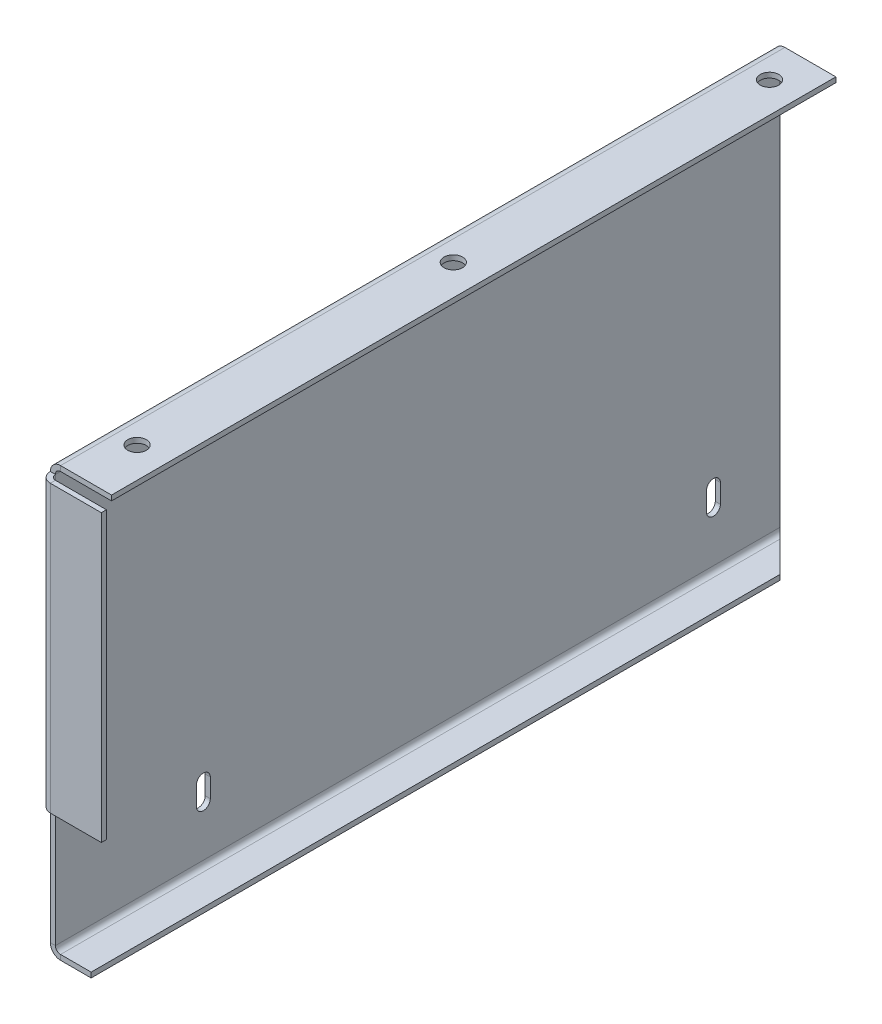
ISO-10303-21;
HEADER;
FILE_DESCRIPTION(('STEP AP214'),'2;1');
FILE_NAME('part.step','',(''),(''),'','','');
FILE_SCHEMA(('AUTOMOTIVE_DESIGN { 1 0 10303 214 1 1 1 1 }'));
ENDSEC;
DATA;
#1=APPLICATION_CONTEXT('core data for automotive mechanical design processes');
#2=APPLICATION_PROTOCOL_DEFINITION('international standard','automotive_design',2000,#1);
#3=PRODUCT_CONTEXT('',#1,'mechanical');
#4=PRODUCT('Part','Part','',(#3));
#5=PRODUCT_RELATED_PRODUCT_CATEGORY('part','',(#4));
#6=PRODUCT_DEFINITION_FORMATION('','',#4);
#7=PRODUCT_DEFINITION_CONTEXT('part definition',#1,'design');
#8=PRODUCT_DEFINITION('design','',#6,#7);
#9=PRODUCT_DEFINITION_SHAPE('','',#8);
#10=(LENGTH_UNIT() NAMED_UNIT(*) SI_UNIT(.MILLI.,.METRE.));
#11=(NAMED_UNIT(*) PLANE_ANGLE_UNIT() SI_UNIT($,.RADIAN.));
#12=(NAMED_UNIT(*) SI_UNIT($,.STERADIAN.) SOLID_ANGLE_UNIT());
#13=UNCERTAINTY_MEASURE_WITH_UNIT(LENGTH_MEASURE(1.E-05),#10,'distance_accuracy_value','');
#14=(GEOMETRIC_REPRESENTATION_CONTEXT(3) GLOBAL_UNCERTAINTY_ASSIGNED_CONTEXT((#13)) GLOBAL_UNIT_ASSIGNED_CONTEXT((#10,
#11,#12)) REPRESENTATION_CONTEXT('',''));
#15=CARTESIAN_POINT('',(0.,0.,0.));
#16=DIRECTION('',(0.,0.,1.));
#17=DIRECTION('',(1.,0.,0.));
#18=AXIS2_PLACEMENT_3D('',#15,#16,#17);
#19=CARTESIAN_POINT('',(0.,-3.33066907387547E-13,355.));
#20=DIRECTION('',(0.,1.,0.));
#21=DIRECTION('',(0.,0.,1.));
#22=AXIS2_PLACEMENT_3D('',#19,#20,#21);
#23=PLANE('',#22);
#24=DIRECTION('',(-0.707106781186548,0.,-0.707106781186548));
#25=VECTOR('',#24,1.);
#26=CARTESIAN_POINT('',(2.5,0.,0.));
#27=LINE('',#26,#25);
#28=CARTESIAN_POINT('',(20.,-3.33066907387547E-13,17.5000000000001));
#29=VERTEX_POINT('',#28);
#30=CARTESIAN_POINT('',(5.00000000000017,0.,2.50000000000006));
#31=VERTEX_POINT('',#30);
#32=EDGE_CURVE('E333',#29,#31,#27,.T.);
#33=ORIENTED_EDGE('',*,*,#32,.F.);
#34=DIRECTION('',(0.,0.,-1.));
#35=VECTOR('',#34,1.);
#36=CARTESIAN_POINT('',(20.,-6.66133814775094E-13,355.));
#37=LINE('',#36,#35);
#38=CARTESIAN_POINT('',(20.,-6.66133814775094E-13,355.));
#39=VERTEX_POINT('',#38);
#40=EDGE_CURVE('E510',#39,#29,#37,.T.);
#41=ORIENTED_EDGE('',*,*,#40,.F.);
#42=DIRECTION('',(1.,0.,0.));
#43=VECTOR('',#42,1.);
#44=CARTESIAN_POINT('',(0.,-3.33066907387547E-13,355.));
#45=LINE('',#44,#43);
#46=CARTESIAN_POINT('',(5.,-3.33066907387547E-13,355.));
#47=VERTEX_POINT('',#46);
#48=EDGE_CURVE('E508',#47,#39,#45,.T.);
#49=ORIENTED_EDGE('',*,*,#48,.F.);
#50=DIRECTION('',(0.,0.,-1.));
#51=VECTOR('',#50,1.);
#52=CARTESIAN_POINT('',(5.,-3.33066907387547E-13,355.));
#53=LINE('',#52,#51);
#54=EDGE_CURVE('E480',#47,#31,#53,.T.);
#55=ORIENTED_EDGE('',*,*,#54,.T.);
#56=EDGE_LOOP('',(#33,#41,#49,#55));
#57=FACE_BOUND('',#56,.T.);
#58=ADVANCED_FACE('F60',(#57),#23,.F.);
#59=CARTESIAN_POINT('',(20.,2.49999999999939,355.));
#60=DIRECTION('',(1.,0.,0.));
#61=DIRECTION('',(0.,0.,-1.));
#62=AXIS2_PLACEMENT_3D('',#59,#60,#61);
#63=PLANE('',#62);
#64=ORIENTED_EDGE('',*,*,#40,.T.);
#65=DIRECTION('',(0.,1.,0.));
#66=VECTOR('',#65,1.);
#67=CARTESIAN_POINT('',(20.,2.49999999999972,17.5000000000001));
#68=LINE('',#67,#66);
#69=CARTESIAN_POINT('',(20.,2.49999999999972,17.5000000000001));
#70=VERTEX_POINT('',#69);
#71=EDGE_CURVE('E338',#70,#29,#68,.F.);
#72=ORIENTED_EDGE('',*,*,#71,.F.);
#73=DIRECTION('',(0.,0.,-1.));
#74=VECTOR('',#73,1.);
#75=CARTESIAN_POINT('',(20.,2.49999999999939,355.));
#76=LINE('',#75,#74);
#77=CARTESIAN_POINT('',(20.,2.49999999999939,355.));
#78=VERTEX_POINT('',#77);
#79=EDGE_CURVE('E542',#78,#70,#76,.T.);
#80=ORIENTED_EDGE('',*,*,#79,.F.);
#81=DIRECTION('',(0.,-1.,0.));
#82=VECTOR('',#81,1.);
#83=CARTESIAN_POINT('',(20.,2.49999999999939,355.));
#84=LINE('',#83,#82);
#85=EDGE_CURVE('E515',#78,#39,#84,.T.);
#86=ORIENTED_EDGE('',*,*,#85,.T.);
#87=EDGE_LOOP('',(#64,#72,#80,#86));
#88=FACE_BOUND('',#87,.T.);
#89=ADVANCED_FACE('F577',(#88),#63,.T.);
#90=CARTESIAN_POINT('',(0.,2.49999999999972,355.));
#91=DIRECTION('',(0.,1.,0.));
#92=DIRECTION('',(0.,0.,1.));
#93=AXIS2_PLACEMENT_3D('',#90,#91,#92);
#94=PLANE('',#93);
#95=ORIENTED_EDGE('',*,*,#79,.T.);
#96=DIRECTION('',(-0.707106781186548,0.,-0.707106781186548));
#97=VECTOR('',#96,1.);
#98=CARTESIAN_POINT('',(2.5,2.50000000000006,0.));
#99=LINE('',#98,#97);
#100=CARTESIAN_POINT('',(5.00000000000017,2.49999999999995,2.50000000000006));
#101=VERTEX_POINT('',#100);
#102=EDGE_CURVE('E329',#70,#101,#99,.T.);
#103=ORIENTED_EDGE('',*,*,#102,.T.);
#104=DIRECTION('',(0.,0.,-1.));
#105=VECTOR('',#104,1.);
#106=CARTESIAN_POINT('',(5.,2.49999999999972,355.));
#107=LINE('',#106,#105);
#108=CARTESIAN_POINT('',(5.,2.49999999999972,355.));
#109=VERTEX_POINT('',#108);
#110=EDGE_CURVE('E535',#109,#101,#107,.T.);
#111=ORIENTED_EDGE('',*,*,#110,.F.);
#112=DIRECTION('',(1.,0.,0.));
#113=VECTOR('',#112,1.);
#114=CARTESIAN_POINT('',(0.,2.49999999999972,355.));
#115=LINE('',#114,#113);
#116=EDGE_CURVE('E519',#109,#78,#115,.T.);
#117=ORIENTED_EDGE('',*,*,#116,.T.);
#118=EDGE_LOOP('',(#95,#103,#111,#117));
#119=FACE_BOUND('',#118,.T.);
#120=ADVANCED_FACE('F571',(#119),#94,.T.);
#121=CARTESIAN_POINT('',(5.,4.99999999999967,355.));
#122=DIRECTION('',(0.,0.,-1.));
#123=DIRECTION('',(-1.,0.,0.));
#124=AXIS2_PLACEMENT_3D('',#121,#122,#123);
#125=CYLINDRICAL_SURFACE('',#124,2.5);
#126=ORIENTED_EDGE('',*,*,#110,.T.);
#127=CARTESIAN_POINT('',(5.00000000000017,5.,2.50000000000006));
#128=DIRECTION('',(-0.707106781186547,0.,0.707106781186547));
#129=DIRECTION('',(-0.707106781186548,0.,-0.707106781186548));
#130=AXIS2_PLACEMENT_3D('',#127,#128,#129);
#131=ELLIPSE('',#130,3.53553390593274,2.5);
#132=CARTESIAN_POINT('',(2.5,5.,0.));
#133=VERTEX_POINT('',#132);
#134=EDGE_CURVE('E322',#101,#133,#131,.F.);
#135=ORIENTED_EDGE('',*,*,#134,.T.);
#136=DIRECTION('',(0.,0.,-1.));
#137=VECTOR('',#136,1.);
#138=CARTESIAN_POINT('',(2.5,4.99999999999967,355.));
#139=LINE('',#138,#137);
#140=CARTESIAN_POINT('',(2.5,4.99999999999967,355.));
#141=VERTEX_POINT('',#140);
#142=EDGE_CURVE('E536',#141,#133,#139,.T.);
#143=ORIENTED_EDGE('',*,*,#142,.F.);
#144=CARTESIAN_POINT('',(5.,4.99999999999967,355.));
#145=DIRECTION('',(0.,0.,1.));
#146=DIRECTION('',(1.,0.,0.));
#147=AXIS2_PLACEMENT_3D('',#144,#145,#146);
#148=CIRCLE('',#147,2.5);
#149=EDGE_CURVE('E429',#141,#109,#148,.T.);
#150=ORIENTED_EDGE('',*,*,#149,.T.);
#151=EDGE_LOOP('',(#126,#135,#143,#150));
#152=FACE_BOUND('',#151,.T.);
#153=ADVANCED_FACE('F534',(#152),#125,.F.);
#154=CARTESIAN_POINT('',(5.,4.99999999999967,355.));
#155=DIRECTION('',(0.,0.,-1.));
#156=DIRECTION('',(-1.,0.,0.));
#157=AXIS2_PLACEMENT_3D('',#154,#155,#156);
#158=CYLINDRICAL_SURFACE('',#157,5.);
#159=CARTESIAN_POINT('',(5.00000000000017,5.,2.50000000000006));
#160=DIRECTION('',(-0.447213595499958,0.,0.894427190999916));
#161=DIRECTION('',(-0.894427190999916,0.,-0.447213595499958));
#162=AXIS2_PLACEMENT_3D('',#159,#160,#161);
#163=ELLIPSE('',#162,5.59016994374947,5.);
#164=CARTESIAN_POINT('',(0.,5.,0.));
#165=VERTEX_POINT('',#164);
#166=EDGE_CURVE('E326',#31,#165,#163,.F.);
#167=ORIENTED_EDGE('',*,*,#166,.F.);
#168=ORIENTED_EDGE('',*,*,#54,.F.);
#169=CARTESIAN_POINT('',(5.,4.99999999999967,355.));
#170=DIRECTION('',(0.,0.,1.));
#171=DIRECTION('',(1.,0.,0.));
#172=AXIS2_PLACEMENT_3D('',#169,#170,#171);
#173=CIRCLE('',#172,5.);
#174=CARTESIAN_POINT('',(0.,4.99999999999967,355.));
#175=VERTEX_POINT('',#174);
#176=EDGE_CURVE('E468',#175,#47,#173,.T.);
#177=ORIENTED_EDGE('',*,*,#176,.F.);
#178=DIRECTION('',(0.,0.,-1.));
#179=VECTOR('',#178,1.);
#180=CARTESIAN_POINT('',(0.,4.99999999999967,355.));
#181=LINE('',#180,#179);
#182=EDGE_CURVE('E492',#175,#165,#181,.T.);
#183=ORIENTED_EDGE('',*,*,#182,.T.);
#184=EDGE_LOOP('',(#167,#168,#177,#183));
#185=FACE_BOUND('',#184,.T.);
#186=ADVANCED_FACE('F501',(#185),#158,.T.);
#187=CARTESIAN_POINT('',(5.,2.49999999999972,355.));
#188=DIRECTION('',(0.,0.,1.));
#189=DIRECTION('',(1.,0.,0.));
#190=AXIS2_PLACEMENT_3D('',#187,#188,#189);
#191=PLANE('',#190);
#192=DIRECTION('',(0.,1.,0.));
#193=VECTOR('',#192,1.);
#194=CARTESIAN_POINT('',(2.5,-3.33066907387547E-13,355.));
#195=LINE('',#194,#193);
#196=CARTESIAN_POINT('',(2.49999999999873,64.9999999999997,355.));
#197=VERTEX_POINT('',#196);
#198=EDGE_CURVE('E421',#197,#141,#195,.F.);
#199=ORIENTED_EDGE('',*,*,#198,.F.);
#200=DIRECTION('',(-1.,0.,0.));
#201=VECTOR('',#200,1.);
#202=CARTESIAN_POINT('',(2.49999999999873,64.9999999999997,355.));
#203=LINE('',#202,#201);
#204=CARTESIAN_POINT('',(0.,64.9999999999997,355.));
#205=VERTEX_POINT('',#204);
#206=EDGE_CURVE('E397',#197,#205,#203,.T.);
#207=ORIENTED_EDGE('',*,*,#206,.T.);
#208=DIRECTION('',(0.,-1.,0.));
#209=VECTOR('',#208,1.);
#210=CARTESIAN_POINT('',(0.,-3.33066907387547E-13,355.));
#211=LINE('',#210,#209);
#212=EDGE_CURVE('E465',#205,#175,#211,.T.);
#213=ORIENTED_EDGE('',*,*,#212,.T.);
#214=DIRECTION('',(1.,0.,0.));
#215=VECTOR('',#214,1.);
#216=CARTESIAN_POINT('',(0.,4.99999999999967,355.));
#217=LINE('',#216,#215);
#218=EDGE_CURVE('E13',#175,#141,#217,.T.);
#219=ORIENTED_EDGE('',*,*,#218,.T.);
#220=EDGE_LOOP('',(#199,#207,#213,#219));
#221=FACE_BOUND('',#220,.T.);
#222=ADVANCED_FACE('F422',(#221),#191,.T.);
#223=CARTESIAN_POINT('',(1.66533453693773E-13,210.,355.));
#224=DIRECTION('',(0.,-1.,0.));
#225=DIRECTION('',(0.,0.,-1.));
#226=AXIS2_PLACEMENT_3D('',#223,#224,#225);
#227=PLANE('',#226);
#228=CARTESIAN_POINT('',(15.,209.999999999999,327.5));
#229=DIRECTION('',(0.,1.,0.));
#230=DIRECTION('',(0.,0.,1.));
#231=AXIS2_PLACEMENT_3D('',#228,#229,#230);
#232=CIRCLE('',#231,4.54999999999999);
#233=CARTESIAN_POINT('',(15.,209.999999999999,332.05));
#234=VERTEX_POINT('',#233);
#235=EDGE_CURVE('E400',#234,#234,#232,.T.);
#236=ORIENTED_EDGE('',*,*,#235,.F.);
#237=EDGE_LOOP('',(#236));
#238=FACE_BOUND('',#237,.T.);
#239=CARTESIAN_POINT('',(15.0000000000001,210.,17.5000000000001));
#240=DIRECTION('',(0.,1.,0.));
#241=DIRECTION('',(0.,0.,1.));
#242=AXIS2_PLACEMENT_3D('',#239,#240,#241);
#243=CIRCLE('',#242,4.54999999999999);
#244=CARTESIAN_POINT('',(15.0000000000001,210.,22.0500000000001));
#245=VERTEX_POINT('',#244);
#246=EDGE_CURVE('E781',#245,#245,#243,.T.);
#247=ORIENTED_EDGE('',*,*,#246,.F.);
#248=EDGE_LOOP('',(#247));
#249=FACE_BOUND('',#248,.T.);
#250=DIRECTION('',(-1.,0.,0.));
#251=VECTOR('',#250,1.);
#252=CARTESIAN_POINT('',(1.66533453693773E-13,210.,0.));
#253=LINE('',#252,#251);
#254=CARTESIAN_POINT('',(30.0000000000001,210.,0.));
#255=VERTEX_POINT('',#254);
#256=CARTESIAN_POINT('',(5.00000000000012,210.,0.));
#257=VERTEX_POINT('',#256);
#258=EDGE_CURVE('E751',#255,#257,#253,.T.);
#259=ORIENTED_EDGE('',*,*,#258,.T.);
#260=DIRECTION('',(0.,0.,-1.));
#261=VECTOR('',#260,1.);
#262=CARTESIAN_POINT('',(5.00000000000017,210.,355.));
#263=LINE('',#262,#261);
#264=CARTESIAN_POINT('',(5.00000000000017,210.,355.));
#265=VERTEX_POINT('',#264);
#266=EDGE_CURVE('E767',#265,#257,#263,.T.);
#267=ORIENTED_EDGE('',*,*,#266,.F.);
#268=DIRECTION('',(-1.,0.,0.));
#269=VECTOR('',#268,1.);
#270=CARTESIAN_POINT('',(1.66533453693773E-13,210.,355.));
#271=LINE('',#270,#269);
#272=CARTESIAN_POINT('',(30.0000000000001,209.999999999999,355.));
#273=VERTEX_POINT('',#272);
#274=EDGE_CURVE('E457',#273,#265,#271,.T.);
#275=ORIENTED_EDGE('',*,*,#274,.F.);
#276=DIRECTION('',(0.,0.,-1.));
#277=VECTOR('',#276,1.);
#278=CARTESIAN_POINT('',(30.0000000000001,209.999999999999,355.));
#279=LINE('',#278,#277);
#280=EDGE_CURVE('E800',#273,#255,#279,.T.);
#281=ORIENTED_EDGE('',*,*,#280,.T.);
#282=EDGE_LOOP('',(#259,#267,#275,#281));
#283=FACE_BOUND('',#282,.T.);
#284=CARTESIAN_POINT('',(15.0000000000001,210.,172.5));
#285=DIRECTION('',(0.,1.,0.));
#286=DIRECTION('',(0.,0.,1.));
#287=AXIS2_PLACEMENT_3D('',#284,#285,#286);
#288=CIRCLE('',#287,4.54999999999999);
#289=CARTESIAN_POINT('',(15.0000000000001,210.,177.05));
#290=VERTEX_POINT('',#289);
#291=EDGE_CURVE('E772',#290,#290,#288,.T.);
#292=ORIENTED_EDGE('',*,*,#291,.F.);
#293=EDGE_LOOP('',(#292));
#294=FACE_BOUND('',#293,.T.);
#295=ADVANCED_FACE('F604',(#238,#249,#283,#294),#227,.F.);
#296=CARTESIAN_POINT('',(0.,4.99999999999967,355.));
#297=DIRECTION('',(0.,0.,1.));
#298=DIRECTION('',(1.,0.,0.));
#299=AXIS2_PLACEMENT_3D('',#296,#297,#298);
#300=PLANE('',#299);
#301=ORIENTED_EDGE('',*,*,#218,.F.);
#302=ORIENTED_EDGE('',*,*,#176,.T.);
#303=DIRECTION('',(0.,-1.,0.));
#304=VECTOR('',#303,1.);
#305=CARTESIAN_POINT('',(5.,2.49999999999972,355.));
#306=LINE('',#305,#304);
#307=EDGE_CURVE('E70',#109,#47,#306,.T.);
#308=ORIENTED_EDGE('',*,*,#307,.F.);
#309=ORIENTED_EDGE('',*,*,#149,.F.);
#310=EDGE_LOOP('',(#301,#302,#308,#309));
#311=FACE_BOUND('',#310,.T.);
#312=ADVANCED_FACE('F62',(#311),#300,.T.);
#313=CARTESIAN_POINT('',(5.00000000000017,210.,355.));
#314=DIRECTION('',(0.,0.,1.));
#315=DIRECTION('',(1.,0.,0.));
#316=AXIS2_PLACEMENT_3D('',#313,#314,#315);
#317=PLANE('',#316);
#318=DIRECTION('',(0.,-1.,0.));
#319=VECTOR('',#318,1.);
#320=CARTESIAN_POINT('',(5.00000000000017,210.,355.));
#321=LINE('',#320,#319);
#322=CARTESIAN_POINT('',(5.00000000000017,207.5,355.));
#323=VERTEX_POINT('',#322);
#324=EDGE_CURVE('E562',#265,#323,#321,.T.);
#325=ORIENTED_EDGE('',*,*,#324,.F.);
#326=CARTESIAN_POINT('',(5.00000000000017,205.,355.));
#327=DIRECTION('',(0.,0.,1.));
#328=DIRECTION('',(1.,0.,0.));
#329=AXIS2_PLACEMENT_3D('',#326,#327,#328);
#330=CIRCLE('',#329,5.);
#331=CARTESIAN_POINT('',(1.66533453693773E-13,205.,355.));
#332=VERTEX_POINT('',#331);
#333=EDGE_CURVE('E461',#265,#332,#330,.T.);
#334=ORIENTED_EDGE('',*,*,#333,.T.);
#335=DIRECTION('',(-1.,0.,0.));
#336=VECTOR('',#335,1.);
#337=CARTESIAN_POINT('',(2.50000000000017,205.,355.));
#338=LINE('',#337,#336);
#339=CARTESIAN_POINT('',(2.50000000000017,205.,355.));
#340=VERTEX_POINT('',#339);
#341=EDGE_CURVE('E559',#340,#332,#338,.T.);
#342=ORIENTED_EDGE('',*,*,#341,.F.);
#343=CARTESIAN_POINT('',(5.00000000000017,205.,355.));
#344=DIRECTION('',(0.,0.,1.));
#345=DIRECTION('',(1.,0.,0.));
#346=AXIS2_PLACEMENT_3D('',#343,#344,#345);
#347=CIRCLE('',#346,2.5);
#348=EDGE_CURVE('E437',#323,#340,#347,.T.);
#349=ORIENTED_EDGE('',*,*,#348,.F.);
#350=EDGE_LOOP('',(#325,#334,#342,#349));
#351=FACE_BOUND('',#350,.T.);
#352=ADVANCED_FACE('F599',(#351),#317,.T.);
#353=CARTESIAN_POINT('',(2.50000000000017,205.,355.));
#354=DIRECTION('',(0.,0.,1.));
#355=DIRECTION('',(1.,0.,0.));
#356=AXIS2_PLACEMENT_3D('',#353,#354,#355);
#357=PLANE('',#356);
#358=ORIENTED_EDGE('',*,*,#274,.T.);
#359=ORIENTED_EDGE('',*,*,#324,.T.);
#360=DIRECTION('',(1.,0.,0.));
#361=VECTOR('',#360,1.);
#362=CARTESIAN_POINT('',(1.66533453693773E-13,207.5,355.));
#363=LINE('',#362,#361);
#364=CARTESIAN_POINT('',(30.0000000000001,207.499999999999,355.));
#365=VERTEX_POINT('',#364);
#366=EDGE_CURVE('E441',#365,#323,#363,.F.);
#367=ORIENTED_EDGE('',*,*,#366,.F.);
#368=DIRECTION('',(0.,-1.,0.));
#369=VECTOR('',#368,1.);
#370=CARTESIAN_POINT('',(30.0000000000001,209.999999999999,355.));
#371=LINE('',#370,#369);
#372=EDGE_CURVE('E453',#273,#365,#371,.T.);
#373=ORIENTED_EDGE('',*,*,#372,.F.);
#374=EDGE_LOOP('',(#358,#359,#367,#373));
#375=FACE_BOUND('',#374,.T.);
#376=ADVANCED_FACE('F595',(#375),#357,.T.);
#377=CARTESIAN_POINT('',(1.66533453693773E-13,205.,0.));
#378=DIRECTION('',(0.,0.,-1.));
#379=DIRECTION('',(-1.,0.,0.));
#380=AXIS2_PLACEMENT_3D('',#377,#378,#379);
#381=PLANE('',#380);
#382=DIRECTION('',(1.,0.,0.));
#383=VECTOR('',#382,1.);
#384=CARTESIAN_POINT('',(1.66533453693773E-13,205.,0.));
#385=LINE('',#384,#383);
#386=CARTESIAN_POINT('',(1.66533453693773E-13,205.,0.));
#387=VERTEX_POINT('',#386);
#388=CARTESIAN_POINT('',(2.50000000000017,205.,0.));
#389=VERTEX_POINT('',#388);
#390=EDGE_CURVE('E556',#387,#389,#385,.T.);
#391=ORIENTED_EDGE('',*,*,#390,.F.);
#392=CARTESIAN_POINT('',(5.00000000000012,205.,0.));
#393=DIRECTION('',(0.,0.,1.));
#394=DIRECTION('',(1.,0.,0.));
#395=AXIS2_PLACEMENT_3D('',#392,#393,#394);
#396=CIRCLE('',#395,5.);
#397=EDGE_CURVE('E522',#257,#387,#396,.T.);
#398=ORIENTED_EDGE('',*,*,#397,.F.);
#399=DIRECTION('',(0.,1.,0.));
#400=VECTOR('',#399,1.);
#401=CARTESIAN_POINT('',(5.00000000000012,207.5,0.));
#402=LINE('',#401,#400);
#403=CARTESIAN_POINT('',(5.00000000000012,207.5,0.));
#404=VERTEX_POINT('',#403);
#405=EDGE_CURVE('E553',#404,#257,#402,.T.);
#406=ORIENTED_EDGE('',*,*,#405,.F.);
#407=CARTESIAN_POINT('',(5.00000000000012,205.,0.));
#408=DIRECTION('',(0.,0.,1.));
#409=DIRECTION('',(1.,0.,0.));
#410=AXIS2_PLACEMENT_3D('',#407,#408,#409);
#411=CIRCLE('',#410,2.5);
#412=EDGE_CURVE('E747',#404,#389,#411,.T.);
#413=ORIENTED_EDGE('',*,*,#412,.T.);
#414=EDGE_LOOP('',(#391,#398,#406,#413));
#415=FACE_BOUND('',#414,.T.);
#416=ADVANCED_FACE('F591',(#415),#381,.T.);
#417=CARTESIAN_POINT('',(5.00000000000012,207.5,0.));
#418=DIRECTION('',(0.,0.,-1.));
#419=DIRECTION('',(-1.,0.,0.));
#420=AXIS2_PLACEMENT_3D('',#417,#418,#419);
#421=PLANE('',#420);
#422=DIRECTION('',(0.,-1.,0.));
#423=VECTOR('',#422,1.);
#424=CARTESIAN_POINT('',(0.,0.,0.));
#425=LINE('',#424,#423);
#426=EDGE_CURVE('E495',#387,#165,#425,.T.);
#427=ORIENTED_EDGE('',*,*,#426,.F.);
#428=ORIENTED_EDGE('',*,*,#390,.T.);
#429=DIRECTION('',(0.,1.,0.));
#430=VECTOR('',#429,1.);
#431=CARTESIAN_POINT('',(2.5,0.,0.));
#432=LINE('',#431,#430);
#433=EDGE_CURVE('E755',#389,#133,#432,.F.);
#434=ORIENTED_EDGE('',*,*,#433,.T.);
#435=DIRECTION('',(-1.,0.,0.));
#436=VECTOR('',#435,1.);
#437=CARTESIAN_POINT('',(2.5,5.,0.));
#438=LINE('',#437,#436);
#439=EDGE_CURVE('E565',#133,#165,#438,.T.);
#440=ORIENTED_EDGE('',*,*,#439,.T.);
#441=EDGE_LOOP('',(#427,#428,#434,#440));
#442=FACE_BOUND('',#441,.T.);
#443=ADVANCED_FACE('F588',(#442),#421,.T.);
#444=CARTESIAN_POINT('',(2.5,-3.33066907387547E-13,355.));
#445=DIRECTION('',(1.,0.,0.));
#446=DIRECTION('',(0.,0.,-1.));
#447=AXIS2_PLACEMENT_3D('',#444,#445,#446);
#448=PLANE('',#447);
#449=CARTESIAN_POINT('',(2.50000000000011,187.5,12.5));
#450=DIRECTION('',(1.,0.,0.));
#451=DIRECTION('',(0.,0.,-1.));
#452=AXIS2_PLACEMENT_3D('',#449,#450,#451);
#453=CIRCLE('',#452,4.55);
#454=CARTESIAN_POINT('',(2.50000000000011,187.5,7.94999999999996));
#455=VERTEX_POINT('',#454);
#456=EDGE_CURVE('E241',#455,#455,#453,.T.);
#457=ORIENTED_EDGE('',*,*,#456,.F.);
#458=EDGE_LOOP('',(#457));
#459=FACE_BOUND('',#458,.T.);
#460=CARTESIAN_POINT('',(2.50000000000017,38.5999999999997,282.5));
#461=DIRECTION('',(1.,0.,0.));
#462=DIRECTION('',(0.,0.,-1.));
#463=AXIS2_PLACEMENT_3D('',#460,#461,#462);
#464=CIRCLE('',#463,3.4);
#465=CARTESIAN_POINT('',(2.50000000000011,38.5999999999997,285.9));
#466=VERTEX_POINT('',#465);
#467=CARTESIAN_POINT('',(2.5,38.5999999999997,279.1));
#468=VERTEX_POINT('',#467);
#469=EDGE_CURVE('E274',#466,#468,#464,.F.);
#470=ORIENTED_EDGE('',*,*,#469,.T.);
#471=DIRECTION('',(0.,-1.,0.));
#472=VECTOR('',#471,1.);
#473=CARTESIAN_POINT('',(2.5,38.5999999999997,279.1));
#474=LINE('',#473,#472);
#475=CARTESIAN_POINT('',(2.5,29.3999999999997,279.1));
#476=VERTEX_POINT('',#475);
#477=EDGE_CURVE('E240',#468,#476,#474,.T.);
#478=ORIENTED_EDGE('',*,*,#477,.T.);
#479=CARTESIAN_POINT('',(2.50000000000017,29.3999999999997,282.5));
#480=DIRECTION('',(1.,0.,0.));
#481=DIRECTION('',(0.,0.,-1.));
#482=AXIS2_PLACEMENT_3D('',#479,#480,#481);
#483=CIRCLE('',#482,3.4);
#484=CARTESIAN_POINT('',(2.50000000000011,29.3999999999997,285.9));
#485=VERTEX_POINT('',#484);
#486=EDGE_CURVE('E78',#476,#485,#483,.F.);
#487=ORIENTED_EDGE('',*,*,#486,.T.);
#488=DIRECTION('',(0.,1.,0.));
#489=VECTOR('',#488,1.);
#490=CARTESIAN_POINT('',(2.50000000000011,38.5999999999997,285.9));
#491=LINE('',#490,#489);
#492=EDGE_CURVE('E268',#485,#466,#491,.T.);
#493=ORIENTED_EDGE('',*,*,#492,.T.);
#494=EDGE_LOOP('',(#470,#478,#487,#493));
#495=FACE_BOUND('',#494,.T.);
#496=CARTESIAN_POINT('',(2.50000000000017,38.6,32.5000000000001));
#497=DIRECTION('',(1.,0.,0.));
#498=DIRECTION('',(0.,0.,-1.));
#499=AXIS2_PLACEMENT_3D('',#496,#497,#498);
#500=CIRCLE('',#499,3.4);
#501=CARTESIAN_POINT('',(2.50000000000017,38.6,35.9));
#502=VERTEX_POINT('',#501);
#503=CARTESIAN_POINT('',(2.50000000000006,38.6,29.1));
#504=VERTEX_POINT('',#503);
#505=EDGE_CURVE('E286',#502,#504,#500,.F.);
#506=ORIENTED_EDGE('',*,*,#505,.T.);
#507=DIRECTION('',(0.,-1.,0.));
#508=VECTOR('',#507,1.);
#509=CARTESIAN_POINT('',(2.50000000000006,38.6,29.1));
#510=LINE('',#509,#508);
#511=CARTESIAN_POINT('',(2.50000000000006,29.4,29.1000000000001));
#512=VERTEX_POINT('',#511);
#513=EDGE_CURVE('E309',#504,#512,#510,.T.);
#514=ORIENTED_EDGE('',*,*,#513,.T.);
#515=CARTESIAN_POINT('',(2.50000000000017,29.4,32.5000000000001));
#516=DIRECTION('',(1.,0.,0.));
#517=DIRECTION('',(0.,0.,-1.));
#518=AXIS2_PLACEMENT_3D('',#515,#516,#517);
#519=CIRCLE('',#518,3.4);
#520=CARTESIAN_POINT('',(2.50000000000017,29.4,35.9));
#521=VERTEX_POINT('',#520);
#522=EDGE_CURVE('E278',#512,#521,#519,.F.);
#523=ORIENTED_EDGE('',*,*,#522,.T.);
#524=DIRECTION('',(0.,1.,0.));
#525=VECTOR('',#524,1.);
#526=CARTESIAN_POINT('',(2.50000000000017,38.6,35.9));
#527=LINE('',#526,#525);
#528=EDGE_CURVE('E282',#521,#502,#527,.T.);
#529=ORIENTED_EDGE('',*,*,#528,.T.);
#530=EDGE_LOOP('',(#506,#514,#523,#529));
#531=FACE_BOUND('',#530,.T.);
#532=ORIENTED_EDGE('',*,*,#433,.F.);
#533=DIRECTION('',(0.,0.,-1.));
#534=VECTOR('',#533,1.);
#535=CARTESIAN_POINT('',(2.50000000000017,205.,355.));
#536=LINE('',#535,#534);
#537=EDGE_CURVE('E435',#340,#389,#536,.T.);
#538=ORIENTED_EDGE('',*,*,#537,.F.);
#539=EDGE_CURVE('E416',#340,#197,#195,.F.);
#540=ORIENTED_EDGE('',*,*,#539,.T.);
#541=ORIENTED_EDGE('',*,*,#198,.T.);
#542=ORIENTED_EDGE('',*,*,#142,.T.);
#543=EDGE_LOOP('',(#532,#538,#540,#541,#542));
#544=FACE_BOUND('',#543,.T.);
#545=ADVANCED_FACE('F433',(#459,#495,#531,#544),#448,.T.);
#546=CARTESIAN_POINT('',(5.00000000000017,205.,355.));
#547=DIRECTION('',(0.,0.,-1.));
#548=DIRECTION('',(-1.,0.,0.));
#549=AXIS2_PLACEMENT_3D('',#546,#547,#548);
#550=CYLINDRICAL_SURFACE('',#549,2.5);
#551=ORIENTED_EDGE('',*,*,#412,.F.);
#552=DIRECTION('',(0.,0.,-1.));
#553=VECTOR('',#552,1.);
#554=CARTESIAN_POINT('',(5.00000000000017,207.5,355.));
#555=LINE('',#554,#553);
#556=EDGE_CURVE('E545',#323,#404,#555,.T.);
#557=ORIENTED_EDGE('',*,*,#556,.F.);
#558=ORIENTED_EDGE('',*,*,#348,.T.);
#559=ORIENTED_EDGE('',*,*,#537,.T.);
#560=EDGE_LOOP('',(#551,#557,#558,#559));
#561=FACE_BOUND('',#560,.T.);
#562=ADVANCED_FACE('F632',(#561),#550,.F.);
#563=CARTESIAN_POINT('',(1.66533453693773E-13,207.5,355.));
#564=DIRECTION('',(0.,-1.,0.));
#565=DIRECTION('',(0.,0.,-1.));
#566=AXIS2_PLACEMENT_3D('',#563,#564,#565);
#567=PLANE('',#566);
#568=CARTESIAN_POINT('',(15.,207.499999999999,327.5));
#569=DIRECTION('',(0.,-1.,0.));
#570=DIRECTION('',(0.,0.,-1.));
#571=AXIS2_PLACEMENT_3D('',#568,#569,#570);
#572=CIRCLE('',#571,4.54999999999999);
#573=CARTESIAN_POINT('',(15.,207.499999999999,322.95));
#574=VERTEX_POINT('',#573);
#575=EDGE_CURVE('E784',#574,#574,#572,.T.);
#576=ORIENTED_EDGE('',*,*,#575,.F.);
#577=EDGE_LOOP('',(#576));
#578=FACE_BOUND('',#577,.T.);
#579=CARTESIAN_POINT('',(15.0000000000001,207.5,17.5000000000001));
#580=DIRECTION('',(0.,-1.,0.));
#581=DIRECTION('',(0.,0.,-1.));
#582=AXIS2_PLACEMENT_3D('',#579,#580,#581);
#583=CIRCLE('',#582,4.54999999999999);
#584=CARTESIAN_POINT('',(15.0000000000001,207.5,12.9500000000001));
#585=VERTEX_POINT('',#584);
#586=EDGE_CURVE('E777',#585,#585,#583,.T.);
#587=ORIENTED_EDGE('',*,*,#586,.F.);
#588=EDGE_LOOP('',(#587));
#589=FACE_BOUND('',#588,.T.);
#590=CARTESIAN_POINT('',(15.0000000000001,207.5,172.5));
#591=DIRECTION('',(0.,-1.,0.));
#592=DIRECTION('',(0.,0.,-1.));
#593=AXIS2_PLACEMENT_3D('',#590,#591,#592);
#594=CIRCLE('',#593,4.54999999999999);
#595=CARTESIAN_POINT('',(15.0000000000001,207.5,167.95));
#596=VERTEX_POINT('',#595);
#597=EDGE_CURVE('E769',#596,#596,#594,.T.);
#598=ORIENTED_EDGE('',*,*,#597,.F.);
#599=EDGE_LOOP('',(#598));
#600=FACE_BOUND('',#599,.T.);
#601=DIRECTION('',(1.,0.,0.));
#602=VECTOR('',#601,1.);
#603=CARTESIAN_POINT('',(1.66533453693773E-13,207.5,0.));
#604=LINE('',#603,#602);
#605=CARTESIAN_POINT('',(30.0000000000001,207.5,0.));
#606=VERTEX_POINT('',#605);
#607=EDGE_CURVE('E740',#606,#404,#604,.F.);
#608=ORIENTED_EDGE('',*,*,#607,.F.);
#609=DIRECTION('',(0.,0.,-1.));
#610=VECTOR('',#609,1.);
#611=CARTESIAN_POINT('',(30.0000000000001,207.499999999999,355.));
#612=LINE('',#611,#610);
#613=EDGE_CURVE('E801',#365,#606,#612,.T.);
#614=ORIENTED_EDGE('',*,*,#613,.F.);
#615=ORIENTED_EDGE('',*,*,#366,.T.);
#616=ORIENTED_EDGE('',*,*,#556,.T.);
#617=EDGE_LOOP('',(#608,#614,#615,#616));
#618=FACE_BOUND('',#617,.T.);
#619=ADVANCED_FACE('F628',(#578,#589,#600,#618),#567,.T.);
#620=CARTESIAN_POINT('',(30.0000000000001,209.999999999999,355.));
#621=DIRECTION('',(1.,0.,0.));
#622=DIRECTION('',(0.,0.,-1.));
#623=AXIS2_PLACEMENT_3D('',#620,#621,#622);
#624=PLANE('',#623);
#625=DIRECTION('',(0.,-1.,0.));
#626=VECTOR('',#625,1.);
#627=CARTESIAN_POINT('',(30.0000000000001,210.,0.));
#628=LINE('',#627,#626);
#629=EDGE_CURVE('E744',#255,#606,#628,.T.);
#630=ORIENTED_EDGE('',*,*,#629,.F.);
#631=ORIENTED_EDGE('',*,*,#280,.F.);
#632=ORIENTED_EDGE('',*,*,#372,.T.);
#633=ORIENTED_EDGE('',*,*,#613,.T.);
#634=EDGE_LOOP('',(#630,#631,#632,#633));
#635=FACE_BOUND('',#634,.T.);
#636=ADVANCED_FACE('F623',(#635),#624,.T.);
#637=CARTESIAN_POINT('',(5.00000000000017,205.,355.));
#638=DIRECTION('',(0.,0.,-1.));
#639=DIRECTION('',(-1.,0.,0.));
#640=AXIS2_PLACEMENT_3D('',#637,#638,#639);
#641=CYLINDRICAL_SURFACE('',#640,5.);
#642=ORIENTED_EDGE('',*,*,#397,.T.);
#643=DIRECTION('',(0.,0.,-1.));
#644=VECTOR('',#643,1.);
#645=CARTESIAN_POINT('',(1.66533453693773E-13,205.,355.));
#646=LINE('',#645,#644);
#647=EDGE_CURVE('E499',#332,#387,#646,.T.);
#648=ORIENTED_EDGE('',*,*,#647,.F.);
#649=ORIENTED_EDGE('',*,*,#333,.F.);
#650=ORIENTED_EDGE('',*,*,#266,.T.);
#651=EDGE_LOOP('',(#642,#648,#649,#650));
#652=FACE_BOUND('',#651,.T.);
#653=ADVANCED_FACE('F620',(#652),#641,.T.);
#654=CARTESIAN_POINT('',(0.,-3.33066907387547E-13,355.));
#655=DIRECTION('',(1.,0.,0.));
#656=DIRECTION('',(0.,0.,-1.));
#657=AXIS2_PLACEMENT_3D('',#654,#655,#656);
#658=PLANE('',#657);
#659=CARTESIAN_POINT('',(1.11022302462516E-13,187.5,12.5));
#660=DIRECTION('',(-1.,0.,0.));
#661=DIRECTION('',(0.,0.,1.));
#662=AXIS2_PLACEMENT_3D('',#659,#660,#661);
#663=CIRCLE('',#662,4.55);
#664=CARTESIAN_POINT('',(1.11022302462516E-13,187.5,17.05));
#665=VERTEX_POINT('',#664);
#666=EDGE_CURVE('E811',#665,#665,#663,.T.);
#667=ORIENTED_EDGE('',*,*,#666,.F.);
#668=EDGE_LOOP('',(#667));
#669=FACE_BOUND('',#668,.T.);
#670=DIRECTION('',(0.,-1.,0.));
#671=VECTOR('',#670,1.);
#672=CARTESIAN_POINT('',(0.,38.5999999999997,279.1));
#673=LINE('',#672,#671);
#674=CARTESIAN_POINT('',(0.,38.5999999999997,279.1));
#675=VERTEX_POINT('',#674);
#676=CARTESIAN_POINT('',(0.,29.3999999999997,279.1));
#677=VERTEX_POINT('',#676);
#678=EDGE_CURVE('E232',#675,#677,#673,.T.);
#679=ORIENTED_EDGE('',*,*,#678,.F.);
#680=CARTESIAN_POINT('',(1.66533453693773E-13,38.5999999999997,282.5));
#681=DIRECTION('',(-1.,0.,0.));
#682=DIRECTION('',(0.,0.,-1.));
#683=AXIS2_PLACEMENT_3D('',#680,#681,#682);
#684=CIRCLE('',#683,3.4);
#685=CARTESIAN_POINT('',(1.66533453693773E-13,38.5999999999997,285.9));
#686=VERTEX_POINT('',#685);
#687=EDGE_CURVE('E86',#686,#675,#684,.T.);
#688=ORIENTED_EDGE('',*,*,#687,.F.);
#689=DIRECTION('',(0.,1.,0.));
#690=VECTOR('',#689,1.);
#691=CARTESIAN_POINT('',(1.66533453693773E-13,38.5999999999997,285.9));
#692=LINE('',#691,#690);
#693=CARTESIAN_POINT('',(1.66533453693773E-13,29.3999999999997,285.9));
#694=VERTEX_POINT('',#693);
#695=EDGE_CURVE('E251',#694,#686,#692,.T.);
#696=ORIENTED_EDGE('',*,*,#695,.F.);
#697=CARTESIAN_POINT('',(1.66533453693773E-13,29.3999999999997,282.5));
#698=DIRECTION('',(-1.,0.,0.));
#699=DIRECTION('',(0.,0.,1.));
#700=AXIS2_PLACEMENT_3D('',#697,#698,#699);
#701=CIRCLE('',#700,3.4);
#702=EDGE_CURVE('E244',#677,#694,#701,.T.);
#703=ORIENTED_EDGE('',*,*,#702,.F.);
#704=EDGE_LOOP('',(#679,#688,#696,#703));
#705=FACE_BOUND('',#704,.T.);
#706=DIRECTION('',(0.,-1.,0.));
#707=VECTOR('',#706,1.);
#708=CARTESIAN_POINT('',(0.,38.6,29.1));
#709=LINE('',#708,#707);
#710=CARTESIAN_POINT('',(0.,38.6,29.1));
#711=VERTEX_POINT('',#710);
#712=CARTESIAN_POINT('',(0.,29.4,29.1));
#713=VERTEX_POINT('',#712);
#714=EDGE_CURVE('E293',#711,#713,#709,.T.);
#715=ORIENTED_EDGE('',*,*,#714,.F.);
#716=CARTESIAN_POINT('',(1.66533453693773E-13,38.6,32.5000000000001));
#717=DIRECTION('',(-1.,0.,0.));
#718=DIRECTION('',(0.,0.,-1.));
#719=AXIS2_PLACEMENT_3D('',#716,#717,#718);
#720=CIRCLE('',#719,3.4);
#721=CARTESIAN_POINT('',(1.66533453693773E-13,38.6,35.9));
#722=VERTEX_POINT('',#721);
#723=EDGE_CURVE('E290',#722,#711,#720,.T.);
#724=ORIENTED_EDGE('',*,*,#723,.F.);
#725=DIRECTION('',(0.,1.,0.));
#726=VECTOR('',#725,1.);
#727=CARTESIAN_POINT('',(1.66533453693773E-13,38.6,35.9));
#728=LINE('',#727,#726);
#729=CARTESIAN_POINT('',(1.66533453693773E-13,29.4,35.9));
#730=VERTEX_POINT('',#729);
#731=EDGE_CURVE('E301',#730,#722,#728,.T.);
#732=ORIENTED_EDGE('',*,*,#731,.F.);
#733=CARTESIAN_POINT('',(1.66533453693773E-13,29.4,32.5000000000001));
#734=DIRECTION('',(-1.,0.,0.));
#735=DIRECTION('',(0.,0.,1.));
#736=AXIS2_PLACEMENT_3D('',#733,#734,#735);
#737=CIRCLE('',#736,3.4);
#738=EDGE_CURVE('E297',#713,#730,#737,.T.);
#739=ORIENTED_EDGE('',*,*,#738,.F.);
#740=EDGE_LOOP('',(#715,#724,#732,#739));
#741=FACE_BOUND('',#740,.T.);
#742=ORIENTED_EDGE('',*,*,#426,.T.);
#743=ORIENTED_EDGE('',*,*,#182,.F.);
#744=ORIENTED_EDGE('',*,*,#212,.F.);
#745=EDGE_CURVE('E472',#332,#205,#211,.T.);
#746=ORIENTED_EDGE('',*,*,#745,.F.);
#747=ORIENTED_EDGE('',*,*,#647,.T.);
#748=EDGE_LOOP('',(#742,#743,#744,#746,#747));
#749=FACE_BOUND('',#748,.T.);
#750=ADVANCED_FACE('F249',(#669,#705,#741,#749),#658,.F.);
#751=CARTESIAN_POINT('',(5.,4.99999999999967,355.));
#752=DIRECTION('',(0.,0.,1.));
#753=DIRECTION('',(1.,0.,0.));
#754=AXIS2_PLACEMENT_3D('',#751,#752,#753);
#755=PLANE('',#754);
#756=ORIENTED_EDGE('',*,*,#48,.T.);
#757=ORIENTED_EDGE('',*,*,#85,.F.);
#758=ORIENTED_EDGE('',*,*,#116,.F.);
#759=ORIENTED_EDGE('',*,*,#307,.T.);
#760=EDGE_LOOP('',(#756,#757,#758,#759));
#761=FACE_BOUND('',#760,.T.);
#762=ADVANCED_FACE('F570',(#761),#755,.T.);
#763=CARTESIAN_POINT('',(5.,5.,0.));
#764=DIRECTION('',(0.,0.,1.));
#765=DIRECTION('',(1.,0.,0.));
#766=AXIS2_PLACEMENT_3D('',#763,#764,#765);
#767=PLANE('',#766);
#768=ORIENTED_EDGE('',*,*,#607,.T.);
#769=ORIENTED_EDGE('',*,*,#405,.T.);
#770=ORIENTED_EDGE('',*,*,#258,.F.);
#771=ORIENTED_EDGE('',*,*,#629,.T.);
#772=EDGE_LOOP('',(#768,#769,#770,#771));
#773=FACE_BOUND('',#772,.T.);
#774=ADVANCED_FACE('F730',(#773),#767,.F.);
#775=CARTESIAN_POINT('',(15.0000000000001,210.,172.5));
#776=DIRECTION('',(0.,1.,0.));
#777=DIRECTION('',(0.,0.,1.));
#778=AXIS2_PLACEMENT_3D('',#775,#776,#777);
#779=CYLINDRICAL_SURFACE('',#778,4.54999999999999);
#780=ORIENTED_EDGE('',*,*,#291,.T.);
#781=EDGE_LOOP('',(#780));
#782=FACE_BOUND('',#781,.T.);
#783=ORIENTED_EDGE('',*,*,#597,.T.);
#784=EDGE_LOOP('',(#783));
#785=FACE_BOUND('',#784,.T.);
#786=ADVANCED_FACE('F727',(#782,#785),#779,.F.);
#787=CARTESIAN_POINT('',(15.0000000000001,210.,17.5000000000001));
#788=DIRECTION('',(0.,1.,0.));
#789=DIRECTION('',(0.,0.,1.));
#790=AXIS2_PLACEMENT_3D('',#787,#788,#789);
#791=CYLINDRICAL_SURFACE('',#790,4.54999999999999);
#792=ORIENTED_EDGE('',*,*,#246,.T.);
#793=EDGE_LOOP('',(#792));
#794=FACE_BOUND('',#793,.T.);
#795=ORIENTED_EDGE('',*,*,#586,.T.);
#796=EDGE_LOOP('',(#795));
#797=FACE_BOUND('',#796,.T.);
#798=ADVANCED_FACE('F723',(#794,#797),#791,.F.);
#799=CARTESIAN_POINT('',(15.,209.999999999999,327.5));
#800=DIRECTION('',(0.,1.,0.));
#801=DIRECTION('',(0.,0.,1.));
#802=AXIS2_PLACEMENT_3D('',#799,#800,#801);
#803=CYLINDRICAL_SURFACE('',#802,4.54999999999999);
#804=ORIENTED_EDGE('',*,*,#235,.T.);
#805=EDGE_LOOP('',(#804));
#806=FACE_BOUND('',#805,.T.);
#807=ORIENTED_EDGE('',*,*,#575,.T.);
#808=EDGE_LOOP('',(#807));
#809=FACE_BOUND('',#808,.T.);
#810=ADVANCED_FACE('F717',(#806,#809),#803,.F.);
#811=CARTESIAN_POINT('',(5.00000000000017,205.,355.));
#812=DIRECTION('',(0.,1.,0.));
#813=DIRECTION('',(-1.,0.,0.));
#814=AXIS2_PLACEMENT_3D('',#811,#812,#813);
#815=PLANE('',#814);
#816=DIRECTION('',(0.,0.,1.));
#817=VECTOR('',#816,1.);
#818=CARTESIAN_POINT('',(5.,205.,360.));
#819=LINE('',#818,#817);
#820=CARTESIAN_POINT('',(5.00000000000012,205.,357.5));
#821=VERTEX_POINT('',#820);
#822=CARTESIAN_POINT('',(5.,205.,360.));
#823=VERTEX_POINT('',#822);
#824=EDGE_CURVE('E341',#821,#823,#819,.T.);
#825=ORIENTED_EDGE('',*,*,#824,.F.);
#826=CARTESIAN_POINT('',(5.00000000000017,205.,355.));
#827=DIRECTION('',(0.,-1.,0.));
#828=DIRECTION('',(1.,0.,0.));
#829=AXIS2_PLACEMENT_3D('',#826,#827,#828);
#830=CIRCLE('',#829,2.5);
#831=EDGE_CURVE('E388',#340,#821,#830,.F.);
#832=ORIENTED_EDGE('',*,*,#831,.F.);
#833=ORIENTED_EDGE('',*,*,#341,.T.);
#834=CARTESIAN_POINT('',(5.00000000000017,205.,355.));
#835=DIRECTION('',(0.,-1.,0.));
#836=DIRECTION('',(1.,0.,0.));
#837=AXIS2_PLACEMENT_3D('',#834,#835,#836);
#838=CIRCLE('',#837,5.);
#839=EDGE_CURVE('E393',#332,#823,#838,.F.);
#840=ORIENTED_EDGE('',*,*,#839,.T.);
#841=EDGE_LOOP('',(#825,#832,#833,#840));
#842=FACE_BOUND('',#841,.T.);
#843=ADVANCED_FACE('F714',(#842),#815,.T.);
#844=CARTESIAN_POINT('',(4.99999999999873,64.9999999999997,355.));
#845=DIRECTION('',(0.,1.,0.));
#846=DIRECTION('',(-1.,0.,0.));
#847=AXIS2_PLACEMENT_3D('',#844,#845,#846);
#848=PLANE('',#847);
#849=CARTESIAN_POINT('',(4.99999999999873,64.9999999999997,355.));
#850=DIRECTION('',(0.,-1.,0.));
#851=DIRECTION('',(1.,0.,0.));
#852=AXIS2_PLACEMENT_3D('',#849,#850,#851);
#853=CIRCLE('',#852,2.5);
#854=CARTESIAN_POINT('',(4.99999999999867,64.9999999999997,357.5));
#855=VERTEX_POINT('',#854);
#856=EDGE_CURVE('E347',#855,#197,#853,.T.);
#857=ORIENTED_EDGE('',*,*,#856,.F.);
#858=DIRECTION('',(0.,0.,1.));
#859=VECTOR('',#858,1.);
#860=CARTESIAN_POINT('',(4.99999999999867,64.9999999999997,357.5));
#861=LINE('',#860,#859);
#862=CARTESIAN_POINT('',(4.99999999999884,64.9999999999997,360.));
#863=VERTEX_POINT('',#862);
#864=EDGE_CURVE('E378',#855,#863,#861,.T.);
#865=ORIENTED_EDGE('',*,*,#864,.T.);
#866=CARTESIAN_POINT('',(4.99999999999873,64.9999999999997,355.));
#867=DIRECTION('',(0.,-1.,0.));
#868=DIRECTION('',(1.,0.,0.));
#869=AXIS2_PLACEMENT_3D('',#866,#867,#868);
#870=CIRCLE('',#869,5.);
#871=EDGE_CURVE('E392',#863,#205,#870,.T.);
#872=ORIENTED_EDGE('',*,*,#871,.T.);
#873=ORIENTED_EDGE('',*,*,#206,.F.);
#874=EDGE_LOOP('',(#857,#865,#872,#873));
#875=FACE_BOUND('',#874,.T.);
#876=ADVANCED_FACE('F711',(#875),#848,.F.);
#877=CARTESIAN_POINT('',(4.99999999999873,64.9999999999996,355.));
#878=DIRECTION('',(0.,-1.,0.));
#879=DIRECTION('',(0.,0.,1.));
#880=AXIS2_PLACEMENT_3D('',#877,#878,#879);
#881=CYLINDRICAL_SURFACE('',#880,5.);
#882=ORIENTED_EDGE('',*,*,#745,.T.);
#883=ORIENTED_EDGE('',*,*,#871,.F.);
#884=DIRECTION('',(0.,-1.,0.));
#885=VECTOR('',#884,1.);
#886=CARTESIAN_POINT('',(4.99999999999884,64.9999999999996,360.));
#887=LINE('',#886,#885);
#888=EDGE_CURVE('E374',#823,#863,#887,.T.);
#889=ORIENTED_EDGE('',*,*,#888,.F.);
#890=ORIENTED_EDGE('',*,*,#839,.F.);
#891=EDGE_LOOP('',(#882,#883,#889,#890));
#892=FACE_BOUND('',#891,.T.);
#893=ADVANCED_FACE('F710',(#892),#881,.T.);
#894=CARTESIAN_POINT('',(4.99999999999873,64.9999999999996,355.));
#895=DIRECTION('',(0.,-1.,0.));
#896=DIRECTION('',(0.,0.,1.));
#897=AXIS2_PLACEMENT_3D('',#894,#895,#896);
#898=CYLINDRICAL_SURFACE('',#897,2.5);
#899=ORIENTED_EDGE('',*,*,#539,.F.);
#900=ORIENTED_EDGE('',*,*,#831,.T.);
#901=DIRECTION('',(0.,1.,0.));
#902=VECTOR('',#901,1.);
#903=CARTESIAN_POINT('',(5.00000000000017,205.,357.5));
#904=LINE('',#903,#902);
#905=EDGE_CURVE('E382',#821,#855,#904,.F.);
#906=ORIENTED_EDGE('',*,*,#905,.T.);
#907=ORIENTED_EDGE('',*,*,#856,.T.);
#908=EDGE_LOOP('',(#899,#900,#906,#907));
#909=FACE_BOUND('',#908,.T.);
#910=ADVANCED_FACE('F414',(#909),#898,.F.);
#911=CARTESIAN_POINT('',(2.49999999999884,64.9999999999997,360.));
#912=DIRECTION('',(0.,-1.,0.));
#913=DIRECTION('',(0.,0.,-1.));
#914=AXIS2_PLACEMENT_3D('',#911,#912,#913);
#915=PLANE('',#914);
#916=DIRECTION('',(-1.,0.,0.));
#917=VECTOR('',#916,1.);
#918=CARTESIAN_POINT('',(2.49999999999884,64.9999999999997,360.));
#919=LINE('',#918,#917);
#920=CARTESIAN_POINT('',(30.0000000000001,64.9999999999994,360.));
#921=VERTEX_POINT('',#920);
#922=EDGE_CURVE('E352',#921,#863,#919,.T.);
#923=ORIENTED_EDGE('',*,*,#922,.T.);
#924=ORIENTED_EDGE('',*,*,#864,.F.);
#925=DIRECTION('',(1.,0.,0.));
#926=VECTOR('',#925,1.);
#927=CARTESIAN_POINT('',(2.49999999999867,64.9999999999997,357.5));
#928=LINE('',#927,#926);
#929=CARTESIAN_POINT('',(30.,64.9999999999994,357.5));
#930=VERTEX_POINT('',#929);
#931=EDGE_CURVE('E363',#930,#855,#928,.F.);
#932=ORIENTED_EDGE('',*,*,#931,.F.);
#933=DIRECTION('',(0.,0.,-1.));
#934=VECTOR('',#933,1.);
#935=CARTESIAN_POINT('',(30.0000000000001,64.9999999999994,360.));
#936=LINE('',#935,#934);
#937=EDGE_CURVE('E344',#921,#930,#936,.T.);
#938=ORIENTED_EDGE('',*,*,#937,.F.);
#939=EDGE_LOOP('',(#923,#924,#932,#938));
#940=FACE_BOUND('',#939,.T.);
#941=ADVANCED_FACE('F698',(#940),#915,.T.);
#942=CARTESIAN_POINT('',(30.,205.,360.));
#943=DIRECTION('',(0.,1.,0.));
#944=DIRECTION('',(0.,0.,1.));
#945=AXIS2_PLACEMENT_3D('',#942,#943,#944);
#946=PLANE('',#945);
#947=DIRECTION('',(-1.,0.,0.));
#948=VECTOR('',#947,1.);
#949=CARTESIAN_POINT('',(2.49999999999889,205.,357.5));
#950=LINE('',#949,#948);
#951=CARTESIAN_POINT('',(30.0000000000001,205.,357.5));
#952=VERTEX_POINT('',#951);
#953=EDGE_CURVE('E371',#821,#952,#950,.F.);
#954=ORIENTED_EDGE('',*,*,#953,.F.);
#955=ORIENTED_EDGE('',*,*,#824,.T.);
#956=DIRECTION('',(1.,0.,0.));
#957=VECTOR('',#956,1.);
#958=CARTESIAN_POINT('',(30.,205.,360.));
#959=LINE('',#958,#957);
#960=CARTESIAN_POINT('',(30.,205.,360.));
#961=VERTEX_POINT('',#960);
#962=EDGE_CURVE('E360',#823,#961,#959,.T.);
#963=ORIENTED_EDGE('',*,*,#962,.T.);
#964=DIRECTION('',(0.,0.,-1.));
#965=VECTOR('',#964,1.);
#966=CARTESIAN_POINT('',(30.,205.,360.));
#967=LINE('',#966,#965);
#968=EDGE_CURVE('E348',#961,#952,#967,.T.);
#969=ORIENTED_EDGE('',*,*,#968,.T.);
#970=EDGE_LOOP('',(#954,#955,#963,#969));
#971=FACE_BOUND('',#970,.T.);
#972=ADVANCED_FACE('F696',(#971),#946,.T.);
#973=CARTESIAN_POINT('',(2.49999999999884,64.9999999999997,360.));
#974=DIRECTION('',(0.,0.,1.));
#975=DIRECTION('',(1.,0.,0.));
#976=AXIS2_PLACEMENT_3D('',#973,#974,#975);
#977=PLANE('',#976);
#978=ORIENTED_EDGE('',*,*,#962,.F.);
#979=ORIENTED_EDGE('',*,*,#888,.T.);
#980=ORIENTED_EDGE('',*,*,#922,.F.);
#981=DIRECTION('',(0.,-1.,0.));
#982=VECTOR('',#981,1.);
#983=CARTESIAN_POINT('',(30.0000000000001,64.9999999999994,360.));
#984=LINE('',#983,#982);
#985=EDGE_CURVE('E356',#961,#921,#984,.T.);
#986=ORIENTED_EDGE('',*,*,#985,.F.);
#987=EDGE_LOOP('',(#978,#979,#980,#986));
#988=FACE_BOUND('',#987,.T.);
#989=ADVANCED_FACE('F692',(#988),#977,.T.);
#990=CARTESIAN_POINT('',(2.49999999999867,64.9999999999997,357.5));
#991=DIRECTION('',(0.,0.,1.));
#992=DIRECTION('',(1.,0.,0.));
#993=AXIS2_PLACEMENT_3D('',#990,#991,#992);
#994=PLANE('',#993);
#995=ORIENTED_EDGE('',*,*,#905,.F.);
#996=ORIENTED_EDGE('',*,*,#953,.T.);
#997=DIRECTION('',(0.,1.,0.));
#998=VECTOR('',#997,1.);
#999=CARTESIAN_POINT('',(30.,64.9999999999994,357.5));
#1000=LINE('',#999,#998);
#1001=EDGE_CURVE('E367',#952,#930,#1000,.F.);
#1002=ORIENTED_EDGE('',*,*,#1001,.T.);
#1003=ORIENTED_EDGE('',*,*,#931,.T.);
#1004=EDGE_LOOP('',(#995,#996,#1002,#1003));
#1005=FACE_BOUND('',#1004,.T.);
#1006=ADVANCED_FACE('F689',(#1005),#994,.F.);
#1007=CARTESIAN_POINT('',(30.0000000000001,64.9999999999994,360.));
#1008=DIRECTION('',(1.,0.,0.));
#1009=DIRECTION('',(0.,0.,-1.));
#1010=AXIS2_PLACEMENT_3D('',#1007,#1008,#1009);
#1011=PLANE('',#1010);
#1012=ORIENTED_EDGE('',*,*,#1001,.F.);
#1013=ORIENTED_EDGE('',*,*,#968,.F.);
#1014=ORIENTED_EDGE('',*,*,#985,.T.);
#1015=ORIENTED_EDGE('',*,*,#937,.T.);
#1016=EDGE_LOOP('',(#1012,#1013,#1014,#1015));
#1017=FACE_BOUND('',#1016,.T.);
#1018=ADVANCED_FACE('F688',(#1017),#1011,.T.);
#1019=CARTESIAN_POINT('',(2.5,2.50000000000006,0.));
#1020=DIRECTION('',(0.707106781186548,0.,-0.707106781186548));
#1021=DIRECTION('',(-0.707106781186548,0.,-0.707106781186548));
#1022=AXIS2_PLACEMENT_3D('',#1019,#1020,#1021);
#1023=PLANE('',#1022);
#1024=ORIENTED_EDGE('',*,*,#102,.F.);
#1025=ORIENTED_EDGE('',*,*,#71,.T.);
#1026=ORIENTED_EDGE('',*,*,#32,.T.);
#1027=DIRECTION('',(0.,1.,0.));
#1028=VECTOR('',#1027,1.);
#1029=CARTESIAN_POINT('',(5.00000000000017,2.49999999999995,2.50000000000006));
#1030=LINE('',#1029,#1028);
#1031=EDGE_CURVE('E337',#101,#31,#1030,.F.);
#1032=ORIENTED_EDGE('',*,*,#1031,.F.);
#1033=EDGE_LOOP('',(#1024,#1025,#1026,#1032));
#1034=FACE_BOUND('',#1033,.T.);
#1035=ADVANCED_FACE('F575',(#1034),#1023,.T.);
#1036=CARTESIAN_POINT('',(0.,5.,0.));
#1037=CARTESIAN_POINT('',(0.833333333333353,5.,0.));
#1038=CARTESIAN_POINT('',(1.66666666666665,5.,0.));
#1039=CARTESIAN_POINT('',(2.5,5.,0.));
#1040=CARTESIAN_POINT('',(0.,14.9999999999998,0.));
#1041=CARTESIAN_POINT('',(0.833333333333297,13.3333333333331,0.));
#1042=CARTESIAN_POINT('',(1.66666666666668,11.6666666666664,0.));
#1043=CARTESIAN_POINT('',(2.49999999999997,9.99999999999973,0.));
#1044=CARTESIAN_POINT('',(9.99999999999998,14.9999999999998,5.00000000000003));
#1045=CARTESIAN_POINT('',(9.16666666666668,13.3333333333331,5.00000000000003));
#1046=CARTESIAN_POINT('',(8.3333333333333,11.6666666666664,5.00000000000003));
#1047=CARTESIAN_POINT('',(7.50000000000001,9.99999999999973,5.00000000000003));
#1048=CARTESIAN_POINT('',(10.0000000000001,4.99999999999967,5.));
#1049=CARTESIAN_POINT('',(9.16666666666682,4.99999999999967,5.));
#1050=CARTESIAN_POINT('',(8.33333333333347,4.99999999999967,5.));
#1051=CARTESIAN_POINT('',(7.50000000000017,4.99999999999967,5.));
#1052=CARTESIAN_POINT('',(9.99999999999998,-5.00000000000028,5.00000000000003));
#1053=CARTESIAN_POINT('',(9.16666666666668,-3.3333333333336,5.00000000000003));
#1054=CARTESIAN_POINT('',(8.3333333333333,-1.66666666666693,5.00000000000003));
#1055=CARTESIAN_POINT('',(7.50000000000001,-2.4980018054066E-13,5.00000000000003));
#1056=CARTESIAN_POINT('',(0.,-5.00000000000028,0.));
#1057=CARTESIAN_POINT('',(0.833333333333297,-3.3333333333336,0.));
#1058=CARTESIAN_POINT('',(1.66666666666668,-1.66666666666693,0.));
#1059=CARTESIAN_POINT('',(2.49999999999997,-2.4980018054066E-13,0.));
#1060=CARTESIAN_POINT('',(0.,5.,0.));
#1061=CARTESIAN_POINT('',(0.833333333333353,5.,0.));
#1062=CARTESIAN_POINT('',(1.66666666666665,5.,0.));
#1063=CARTESIAN_POINT('',(2.5,5.,0.));
#1064=(BOUNDED_SURFACE() B_SPLINE_SURFACE(3,3,((#1036,#1037,#1038,#1039),(#1040,#1041,#1042,
#1043),(#1044,#1045,#1046,#1047),(#1048,#1049,#1050,#1051),(#1052,#1053,#1054,#1055),(#1056,
#1057,#1058,#1059),(#1060,#1061,#1062,#1063)),.UNSPECIFIED.,.T.,.F.,
.F.) B_SPLINE_SURFACE_WITH_KNOTS((4,3,4),(4,4),(0.,0.5,1.),(0.,1.),
.UNSPECIFIED.) GEOMETRIC_REPRESENTATION_ITEM() RATIONAL_B_SPLINE_SURFACE(((1.,1.,1.,1.),
(0.333333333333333,0.333333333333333,0.333333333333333,0.333333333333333),(0.333333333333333,
0.333333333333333,0.333333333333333,0.333333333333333),(1.,1.,1.,1.),(0.333333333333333,
0.333333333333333,0.333333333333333,0.333333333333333),(0.333333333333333,0.333333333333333,
0.333333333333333,0.333333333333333),(1.,1.,1.,1.))) REPRESENTATION_ITEM('') SURFACE());
#1065=ORIENTED_EDGE('',*,*,#134,.F.);
#1066=ORIENTED_EDGE('',*,*,#1031,.T.);
#1067=ORIENTED_EDGE('',*,*,#166,.T.);
#1068=ORIENTED_EDGE('',*,*,#439,.F.);
#1069=EDGE_LOOP('',(#1065,#1066,#1067,#1068));
#1070=FACE_BOUND('',#1069,.T.);
#1071=ADVANCED_FACE('F675',(#1070),#1064,.T.);
#1072=CARTESIAN_POINT('',(30.0010000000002,38.5999999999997,32.5000000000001));
#1073=DIRECTION('',(-1.,0.,0.));
#1074=DIRECTION('',(0.,0.,1.));
#1075=AXIS2_PLACEMENT_3D('',#1072,#1073,#1074);
#1076=CYLINDRICAL_SURFACE('',#1075,3.4);
#1077=DIRECTION('',(-1.,0.,0.));
#1078=VECTOR('',#1077,1.);
#1079=CARTESIAN_POINT('',(30.0010000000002,38.5999999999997,35.9));
#1080=LINE('',#1079,#1078);
#1081=EDGE_CURVE('E306',#502,#722,#1080,.T.);
#1082=ORIENTED_EDGE('',*,*,#1081,.T.);
#1083=ORIENTED_EDGE('',*,*,#723,.T.);
#1084=DIRECTION('',(-1.,0.,0.));
#1085=VECTOR('',#1084,1.);
#1086=CARTESIAN_POINT('',(30.0010000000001,38.5999999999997,29.1));
#1087=LINE('',#1086,#1085);
#1088=EDGE_CURVE('E305',#504,#711,#1087,.T.);
#1089=ORIENTED_EDGE('',*,*,#1088,.F.);
#1090=ORIENTED_EDGE('',*,*,#505,.F.);
#1091=EDGE_LOOP('',(#1082,#1083,#1089,#1090));
#1092=FACE_BOUND('',#1091,.T.);
#1093=ADVANCED_FACE('F649',(#1092),#1076,.F.);
#1094=CARTESIAN_POINT('',(30.0010000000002,38.5999999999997,35.9));
#1095=DIRECTION('',(0.,0.,1.));
#1096=DIRECTION('',(1.,0.,0.));
#1097=AXIS2_PLACEMENT_3D('',#1094,#1095,#1096);
#1098=PLANE('',#1097);
#1099=DIRECTION('',(-1.,0.,0.));
#1100=VECTOR('',#1099,1.);
#1101=CARTESIAN_POINT('',(30.0010000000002,29.3999999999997,35.9));
#1102=LINE('',#1101,#1100);
#1103=EDGE_CURVE('E310',#521,#730,#1102,.T.);
#1104=ORIENTED_EDGE('',*,*,#1103,.T.);
#1105=ORIENTED_EDGE('',*,*,#731,.T.);
#1106=ORIENTED_EDGE('',*,*,#1081,.F.);
#1107=ORIENTED_EDGE('',*,*,#528,.F.);
#1108=EDGE_LOOP('',(#1104,#1105,#1106,#1107));
#1109=FACE_BOUND('',#1108,.T.);
#1110=ADVANCED_FACE('F651',(#1109),#1098,.F.);
#1111=CARTESIAN_POINT('',(30.0010000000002,29.3999999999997,32.5000000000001));
#1112=DIRECTION('',(-1.,0.,0.));
#1113=DIRECTION('',(0.,0.,1.));
#1114=AXIS2_PLACEMENT_3D('',#1111,#1112,#1113);
#1115=CYLINDRICAL_SURFACE('',#1114,3.4);
#1116=DIRECTION('',(-1.,0.,0.));
#1117=VECTOR('',#1116,1.);
#1118=CARTESIAN_POINT('',(30.0010000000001,29.3999999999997,29.1));
#1119=LINE('',#1118,#1117);
#1120=EDGE_CURVE('E313',#512,#713,#1119,.T.);
#1121=ORIENTED_EDGE('',*,*,#1120,.T.);
#1122=ORIENTED_EDGE('',*,*,#738,.T.);
#1123=ORIENTED_EDGE('',*,*,#1103,.F.);
#1124=ORIENTED_EDGE('',*,*,#522,.F.);
#1125=EDGE_LOOP('',(#1121,#1122,#1123,#1124));
#1126=FACE_BOUND('',#1125,.T.);
#1127=ADVANCED_FACE('F661',(#1126),#1115,.F.);
#1128=CARTESIAN_POINT('',(30.0010000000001,38.5999999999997,29.1));
#1129=DIRECTION('',(0.,0.,-1.));
#1130=DIRECTION('',(-1.,0.,0.));
#1131=AXIS2_PLACEMENT_3D('',#1128,#1129,#1130);
#1132=PLANE('',#1131);
#1133=ORIENTED_EDGE('',*,*,#1088,.T.);
#1134=ORIENTED_EDGE('',*,*,#714,.T.);
#1135=ORIENTED_EDGE('',*,*,#1120,.F.);
#1136=ORIENTED_EDGE('',*,*,#513,.F.);
#1137=EDGE_LOOP('',(#1133,#1134,#1135,#1136));
#1138=FACE_BOUND('',#1137,.T.);
#1139=ADVANCED_FACE('F658',(#1138),#1132,.F.);
#1140=CARTESIAN_POINT('',(30.0010000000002,38.5999999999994,282.5));
#1141=DIRECTION('',(-1.,0.,0.));
#1142=DIRECTION('',(0.,0.,1.));
#1143=AXIS2_PLACEMENT_3D('',#1140,#1141,#1142);
#1144=CYLINDRICAL_SURFACE('',#1143,3.4);
#1145=DIRECTION('',(-1.,0.,0.));
#1146=VECTOR('',#1145,1.);
#1147=CARTESIAN_POINT('',(30.0010000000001,38.5999999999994,285.9));
#1148=LINE('',#1147,#1146);
#1149=EDGE_CURVE('E265',#466,#686,#1148,.T.);
#1150=ORIENTED_EDGE('',*,*,#1149,.T.);
#1151=ORIENTED_EDGE('',*,*,#687,.T.);
#1152=DIRECTION('',(-1.,0.,0.));
#1153=VECTOR('',#1152,1.);
#1154=CARTESIAN_POINT('',(30.001,38.5999999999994,279.1));
#1155=LINE('',#1154,#1153);
#1156=EDGE_CURVE('E236',#468,#675,#1155,.T.);
#1157=ORIENTED_EDGE('',*,*,#1156,.F.);
#1158=ORIENTED_EDGE('',*,*,#469,.F.);
#1159=EDGE_LOOP('',(#1150,#1151,#1157,#1158));
#1160=FACE_BOUND('',#1159,.T.);
#1161=ADVANCED_FACE('F668',(#1160),#1144,.F.);
#1162=CARTESIAN_POINT('',(30.0010000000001,38.5999999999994,285.9));
#1163=DIRECTION('',(0.,0.,1.));
#1164=DIRECTION('',(1.,0.,0.));
#1165=AXIS2_PLACEMENT_3D('',#1162,#1163,#1164);
#1166=PLANE('',#1165);
#1167=DIRECTION('',(-1.,0.,0.));
#1168=VECTOR('',#1167,1.);
#1169=CARTESIAN_POINT('',(30.0010000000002,29.3999999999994,285.9));
#1170=LINE('',#1169,#1168);
#1171=EDGE_CURVE('E253',#485,#694,#1170,.T.);
#1172=ORIENTED_EDGE('',*,*,#1171,.T.);
#1173=ORIENTED_EDGE('',*,*,#695,.T.);
#1174=ORIENTED_EDGE('',*,*,#1149,.F.);
#1175=ORIENTED_EDGE('',*,*,#492,.F.);
#1176=EDGE_LOOP('',(#1172,#1173,#1174,#1175));
#1177=FACE_BOUND('',#1176,.T.);
#1178=ADVANCED_FACE('F823',(#1177),#1166,.F.);
#1179=CARTESIAN_POINT('',(30.0010000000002,29.3999999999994,282.5));
#1180=DIRECTION('',(-1.,0.,0.));
#1181=DIRECTION('',(0.,0.,1.));
#1182=AXIS2_PLACEMENT_3D('',#1179,#1180,#1181);
#1183=CYLINDRICAL_SURFACE('',#1182,3.4);
#1184=DIRECTION('',(-1.,0.,0.));
#1185=VECTOR('',#1184,1.);
#1186=CARTESIAN_POINT('',(30.001,29.3999999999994,279.1));
#1187=LINE('',#1186,#1185);
#1188=EDGE_CURVE('E234',#476,#677,#1187,.T.);
#1189=ORIENTED_EDGE('',*,*,#1188,.T.);
#1190=ORIENTED_EDGE('',*,*,#702,.T.);
#1191=ORIENTED_EDGE('',*,*,#1171,.F.);
#1192=ORIENTED_EDGE('',*,*,#486,.F.);
#1193=EDGE_LOOP('',(#1189,#1190,#1191,#1192));
#1194=FACE_BOUND('',#1193,.T.);
#1195=ADVANCED_FACE('F243',(#1194),#1183,.F.);
#1196=CARTESIAN_POINT('',(30.001,38.5999999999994,279.1));
#1197=DIRECTION('',(0.,0.,-1.));
#1198=DIRECTION('',(-1.,0.,0.));
#1199=AXIS2_PLACEMENT_3D('',#1196,#1197,#1198);
#1200=PLANE('',#1199);
#1201=ORIENTED_EDGE('',*,*,#1156,.T.);
#1202=ORIENTED_EDGE('',*,*,#678,.T.);
#1203=ORIENTED_EDGE('',*,*,#1188,.F.);
#1204=ORIENTED_EDGE('',*,*,#477,.F.);
#1205=EDGE_LOOP('',(#1201,#1202,#1203,#1204));
#1206=FACE_BOUND('',#1205,.T.);
#1207=ADVANCED_FACE('F233',(#1206),#1200,.F.);
#1208=CARTESIAN_POINT('',(1.11022302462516E-13,187.5,12.5));
#1209=DIRECTION('',(-1.,0.,0.));
#1210=DIRECTION('',(0.,0.,1.));
#1211=AXIS2_PLACEMENT_3D('',#1208,#1209,#1210);
#1212=CYLINDRICAL_SURFACE('',#1211,4.55);
#1213=ORIENTED_EDGE('',*,*,#456,.T.);
#1214=EDGE_LOOP('',(#1213));
#1215=FACE_BOUND('',#1214,.T.);
#1216=ORIENTED_EDGE('',*,*,#666,.T.);
#1217=EDGE_LOOP('',(#1216));
#1218=FACE_BOUND('',#1217,.T.);
#1219=ADVANCED_FACE('F831',(#1215,#1218),#1212,.F.);
#1220=CLOSED_SHELL('',(#58,#89,#120,#153,#186,#222,#295,#312,#352,#376,#416,#443,#545,#562,#619,
#636,#653,#750,#762,#774,#786,#798,#810,#843,#876,#893,#910,#941,#972,#989,#1006,#1018,#1035,
#1071,#1093,#1110,#1127,#1139,#1161,#1178,#1195,#1207,#1219));
#1221=MANIFOLD_SOLID_BREP('B2',#1220);
#1222=ADVANCED_BREP_SHAPE_REPRESENTATION('',(#18,#1221),#14);
#1223=SHAPE_DEFINITION_REPRESENTATION(#9,#1222);
ENDSEC;
END-ISO-10303-21;
